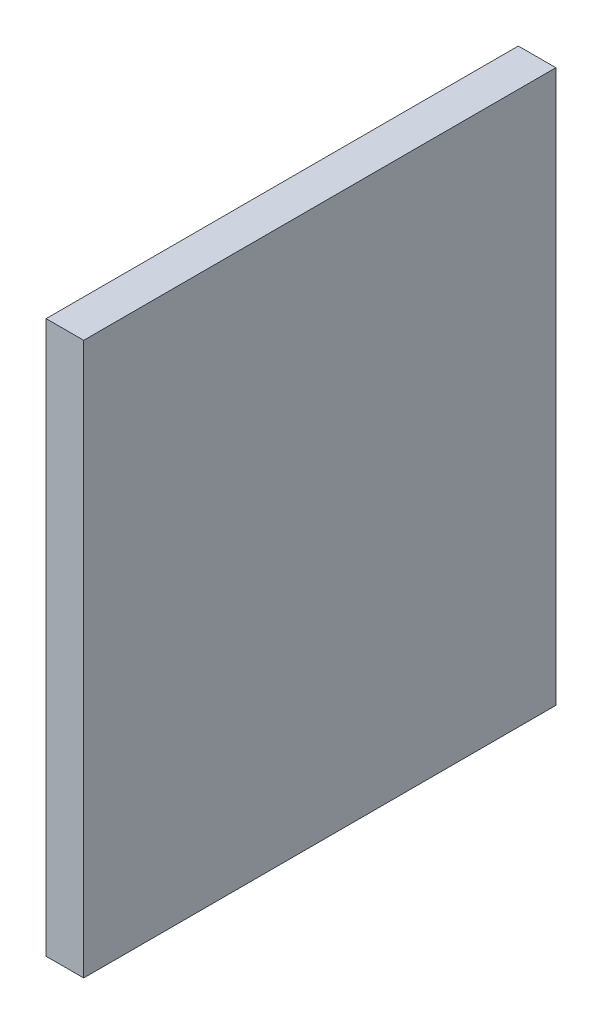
from build123d import *

# Parameters (mm, degrees)
SKETCH1_W           = 201.1
SKETCH1_H           = 235.2
BOSS_EXTRUDE1_DEPTH = 16


with BuildPart() as part:
    # Sketch1 → Boss-Extrude1 (new body)
    with BuildSketch(Plane(origin=(0, 0, 0), x_dir=(0, 0, -1), z_dir=(1, 0, 0))):
        Rectangle(SKETCH1_W, SKETCH1_H)
    extrude(amount=BOSS_EXTRUDE1_DEPTH)


solid = part.part
